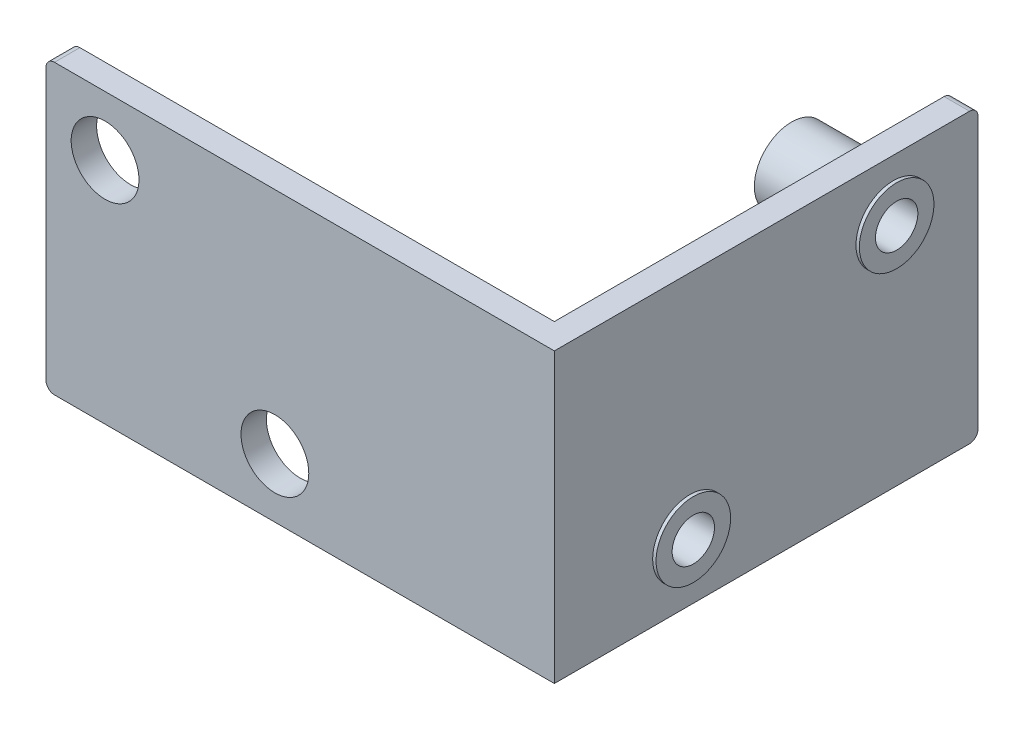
ISO-10303-21;
HEADER;
FILE_DESCRIPTION(('STEP AP214'),'2;1');
FILE_NAME('part.step','',(''),(''),'','','');
FILE_SCHEMA(('AUTOMOTIVE_DESIGN { 1 0 10303 214 1 1 1 1 }'));
ENDSEC;
DATA;
#1=APPLICATION_CONTEXT('core data for automotive mechanical design processes');
#2=APPLICATION_PROTOCOL_DEFINITION('international standard','automotive_design',2000,#1);
#3=PRODUCT_CONTEXT('',#1,'mechanical');
#4=PRODUCT('Part','Part','',(#3));
#5=PRODUCT_RELATED_PRODUCT_CATEGORY('part','',(#4));
#6=PRODUCT_DEFINITION_FORMATION('','',#4);
#7=PRODUCT_DEFINITION_CONTEXT('part definition',#1,'design');
#8=PRODUCT_DEFINITION('design','',#6,#7);
#9=PRODUCT_DEFINITION_SHAPE('','',#8);
#10=(LENGTH_UNIT() NAMED_UNIT(*) SI_UNIT(.MILLI.,.METRE.));
#11=(NAMED_UNIT(*) PLANE_ANGLE_UNIT() SI_UNIT($,.RADIAN.));
#12=(NAMED_UNIT(*) SI_UNIT($,.STERADIAN.) SOLID_ANGLE_UNIT());
#13=UNCERTAINTY_MEASURE_WITH_UNIT(LENGTH_MEASURE(1.E-05),#10,'distance_accuracy_value','');
#14=(GEOMETRIC_REPRESENTATION_CONTEXT(3) GLOBAL_UNCERTAINTY_ASSIGNED_CONTEXT((#13)) GLOBAL_UNIT_ASSIGNED_CONTEXT((#10,
#11,#12)) REPRESENTATION_CONTEXT('',''));
#15=CARTESIAN_POINT('',(0.,0.,0.));
#16=DIRECTION('',(0.,0.,1.));
#17=DIRECTION('',(1.,0.,0.));
#18=AXIS2_PLACEMENT_3D('',#15,#16,#17);
#19=CARTESIAN_POINT('',(21.0510654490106,-18.5667427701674,1.5));
#20=DIRECTION('',(-1.,0.,0.));
#21=DIRECTION('',(0.,0.,1.));
#22=AXIS2_PLACEMENT_3D('',#19,#20,#21);
#23=PLANE('',#22);
#24=CARTESIAN_POINT('',(21.0510654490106,-15.1074405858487,-6.5));
#25=DIRECTION('',(-1.,0.,0.));
#26=DIRECTION('',(0.,0.,1.));
#27=AXIS2_PLACEMENT_3D('',#24,#25,#26);
#28=CIRCLE('',#27,2.2);
#29=CARTESIAN_POINT('',(21.0510654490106,-15.1074405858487,-4.3));
#30=VERTEX_POINT('',#29);
#31=EDGE_CURVE('E169',#30,#30,#28,.F.);
#32=ORIENTED_EDGE('',*,*,#31,.F.);
#33=EDGE_LOOP('',(#32));
#34=FACE_BOUND('',#33,.T.);
#35=DIRECTION('',(0.,0.,-1.));
#36=VECTOR('',#35,1.);
#37=CARTESIAN_POINT('',(21.0510654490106,-18.5667427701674,1.5));
#38=LINE('',#37,#36);
#39=CARTESIAN_POINT('',(21.0510654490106,-18.5667427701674,1.5));
#40=VERTEX_POINT('',#39);
#41=CARTESIAN_POINT('',(21.0510654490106,-18.5667427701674,-23.));
#42=VERTEX_POINT('',#41);
#43=EDGE_CURVE('E221',#40,#42,#38,.T.);
#44=ORIENTED_EDGE('',*,*,#43,.T.);
#45=CARTESIAN_POINT('',(21.0510654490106,-18.0667427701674,-23.));
#46=DIRECTION('',(-1.,0.,0.));
#47=DIRECTION('',(0.,0.,1.));
#48=AXIS2_PLACEMENT_3D('',#45,#46,#47);
#49=CIRCLE('',#48,0.5);
#50=CARTESIAN_POINT('',(21.0510654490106,-18.0667427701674,-23.5));
#51=VERTEX_POINT('',#50);
#52=EDGE_CURVE('E198',#42,#51,#49,.F.);
#53=ORIENTED_EDGE('',*,*,#52,.T.);
#54=DIRECTION('',(0.,-1.,0.));
#55=VECTOR('',#54,1.);
#56=CARTESIAN_POINT('',(21.0510654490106,-1.56674277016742,-23.5));
#57=LINE('',#56,#55);
#58=CARTESIAN_POINT('',(21.0510654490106,-2.06674277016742,-23.5));
#59=VERTEX_POINT('',#58);
#60=EDGE_CURVE('E153',#59,#51,#57,.T.);
#61=ORIENTED_EDGE('',*,*,#60,.F.);
#62=CARTESIAN_POINT('',(21.0510654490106,-2.06674277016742,-23.));
#63=DIRECTION('',(-1.,0.,0.));
#64=DIRECTION('',(0.,0.,1.));
#65=AXIS2_PLACEMENT_3D('',#62,#63,#64);
#66=CIRCLE('',#65,0.5);
#67=CARTESIAN_POINT('',(21.0510654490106,-1.56674277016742,-23.));
#68=VERTEX_POINT('',#67);
#69=EDGE_CURVE('E196',#59,#68,#66,.F.);
#70=ORIENTED_EDGE('',*,*,#69,.T.);
#71=DIRECTION('',(0.,0.,-1.));
#72=VECTOR('',#71,1.);
#73=CARTESIAN_POINT('',(21.0510654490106,-1.56674277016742,1.5));
#74=LINE('',#73,#72);
#75=CARTESIAN_POINT('',(21.0510654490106,-1.56674277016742,1.5));
#76=VERTEX_POINT('',#75);
#77=EDGE_CURVE('E229',#76,#68,#74,.T.);
#78=ORIENTED_EDGE('',*,*,#77,.F.);
#79=DIRECTION('',(0.,1.,0.));
#80=VECTOR('',#79,1.);
#81=CARTESIAN_POINT('',(21.0510654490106,-18.5667427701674,1.5));
#82=LINE('',#81,#80);
#83=EDGE_CURVE('E223',#40,#76,#82,.T.);
#84=ORIENTED_EDGE('',*,*,#83,.F.);
#85=EDGE_LOOP('',(#44,#53,#61,#70,#78,#84));
#86=FACE_BOUND('',#85,.T.);
#87=CARTESIAN_POINT('',(21.0510654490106,-5.06674277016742,-18.5));
#88=DIRECTION('',(-1.,0.,0.));
#89=DIRECTION('',(0.,0.,1.));
#90=AXIS2_PLACEMENT_3D('',#87,#88,#89);
#91=CIRCLE('',#90,2.2);
#92=CARTESIAN_POINT('',(21.0510654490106,-5.06674277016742,-16.3));
#93=VERTEX_POINT('',#92);
#94=EDGE_CURVE('E479',#93,#93,#91,.F.);
#95=ORIENTED_EDGE('',*,*,#94,.F.);
#96=EDGE_LOOP('',(#95));
#97=FACE_BOUND('',#96,.T.);
#98=ADVANCED_FACE('F46',(#34,#86,#97),#23,.F.);
#99=CARTESIAN_POINT('',(19.5510654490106,-1.56674277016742,-23.5));
#100=DIRECTION('',(1.,0.,0.));
#101=DIRECTION('',(0.,1.,0.));
#102=AXIS2_PLACEMENT_3D('',#99,#100,#101);
#103=PLANE('',#102);
#104=CARTESIAN_POINT('',(19.5510654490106,-15.1074405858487,-6.5));
#105=DIRECTION('',(1.,0.,0.));
#106=DIRECTION('',(0.,1.,0.));
#107=AXIS2_PLACEMENT_3D('',#104,#105,#106);
#108=CIRCLE('',#107,2.2);
#109=CARTESIAN_POINT('',(19.5510654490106,-12.9074405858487,-6.5));
#110=VERTEX_POINT('',#109);
#111=EDGE_CURVE('E232',#110,#110,#108,.F.);
#112=ORIENTED_EDGE('',*,*,#111,.F.);
#113=EDGE_LOOP('',(#112));
#114=FACE_BOUND('',#113,.T.);
#115=DIRECTION('',(0.,1.,0.));
#116=VECTOR('',#115,1.);
#117=CARTESIAN_POINT('',(19.5510654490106,-1.56674277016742,-23.5));
#118=LINE('',#117,#116);
#119=CARTESIAN_POINT('',(19.5510654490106,-18.0667427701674,-23.5));
#120=VERTEX_POINT('',#119);
#121=CARTESIAN_POINT('',(19.5510654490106,-2.06674277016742,-23.5));
#122=VERTEX_POINT('',#121);
#123=EDGE_CURVE('E135',#120,#122,#118,.T.);
#124=ORIENTED_EDGE('',*,*,#123,.F.);
#125=CARTESIAN_POINT('',(19.5510654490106,-18.0667427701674,-23.));
#126=DIRECTION('',(1.,0.,0.));
#127=DIRECTION('',(0.,1.,0.));
#128=AXIS2_PLACEMENT_3D('',#125,#126,#127);
#129=CIRCLE('',#128,0.5);
#130=CARTESIAN_POINT('',(19.5510654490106,-18.5667427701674,-23.));
#131=VERTEX_POINT('',#130);
#132=EDGE_CURVE('E189',#120,#131,#129,.F.);
#133=ORIENTED_EDGE('',*,*,#132,.T.);
#134=DIRECTION('',(0.,0.,1.));
#135=VECTOR('',#134,1.);
#136=CARTESIAN_POINT('',(19.5510654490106,-18.5667427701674,-23.5));
#137=LINE('',#136,#135);
#138=CARTESIAN_POINT('',(19.5510654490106,-18.5667427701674,0.));
#139=VERTEX_POINT('',#138);
#140=EDGE_CURVE('E134',#131,#139,#137,.T.);
#141=ORIENTED_EDGE('',*,*,#140,.T.);
#142=DIRECTION('',(0.,1.,0.));
#143=VECTOR('',#142,1.);
#144=CARTESIAN_POINT('',(19.5510654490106,-1.56674277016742,0.));
#145=LINE('',#144,#143);
#146=CARTESIAN_POINT('',(19.5510654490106,-1.56674277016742,0.));
#147=VERTEX_POINT('',#146);
#148=EDGE_CURVE('E142',#139,#147,#145,.T.);
#149=ORIENTED_EDGE('',*,*,#148,.T.);
#150=DIRECTION('',(0.,0.,1.));
#151=VECTOR('',#150,1.);
#152=CARTESIAN_POINT('',(19.5510654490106,-1.56674277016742,-23.5));
#153=LINE('',#152,#151);
#154=CARTESIAN_POINT('',(19.5510654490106,-1.56674277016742,-23.));
#155=VERTEX_POINT('',#154);
#156=EDGE_CURVE('E123',#155,#147,#153,.T.);
#157=ORIENTED_EDGE('',*,*,#156,.F.);
#158=CARTESIAN_POINT('',(19.5510654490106,-2.06674277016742,-23.));
#159=DIRECTION('',(1.,0.,0.));
#160=DIRECTION('',(0.,1.,0.));
#161=AXIS2_PLACEMENT_3D('',#158,#159,#160);
#162=CIRCLE('',#161,0.5);
#163=EDGE_CURVE('E466',#155,#122,#162,.F.);
#164=ORIENTED_EDGE('',*,*,#163,.T.);
#165=EDGE_LOOP('',(#124,#133,#141,#149,#157,#164));
#166=FACE_BOUND('',#165,.T.);
#167=CARTESIAN_POINT('',(19.5510654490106,-5.06674277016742,-18.5));
#168=DIRECTION('',(1.,0.,0.));
#169=DIRECTION('',(0.,1.,0.));
#170=AXIS2_PLACEMENT_3D('',#167,#168,#169);
#171=CIRCLE('',#170,2.2);
#172=CARTESIAN_POINT('',(19.5510654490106,-2.86674277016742,-18.5));
#173=VERTEX_POINT('',#172);
#174=EDGE_CURVE('E476',#173,#173,#171,.F.);
#175=ORIENTED_EDGE('',*,*,#174,.F.);
#176=EDGE_LOOP('',(#175));
#177=FACE_BOUND('',#176,.T.);
#178=ADVANCED_FACE('F150',(#114,#166,#177),#103,.F.);
#179=CARTESIAN_POINT('',(-8.94893455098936,-18.5667427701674,1.5));
#180=DIRECTION('',(1.,0.,0.));
#181=DIRECTION('',(0.,0.,-1.));
#182=AXIS2_PLACEMENT_3D('',#179,#180,#181);
#183=PLANE('',#182);
#184=DIRECTION('',(0.,-1.,0.));
#185=VECTOR('',#184,1.);
#186=CARTESIAN_POINT('',(-8.94893455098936,-18.5667427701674,0.));
#187=LINE('',#186,#185);
#188=CARTESIAN_POINT('',(-8.94893455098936,-2.06674277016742,0.));
#189=VERTEX_POINT('',#188);
#190=CARTESIAN_POINT('',(-8.94893455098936,-18.0667427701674,0.));
#191=VERTEX_POINT('',#190);
#192=EDGE_CURVE('E181',#189,#191,#187,.T.);
#193=ORIENTED_EDGE('',*,*,#192,.T.);
#194=DIRECTION('',(0.,0.,-1.));
#195=VECTOR('',#194,1.);
#196=CARTESIAN_POINT('',(-8.94893455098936,-18.0667427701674,1.5));
#197=LINE('',#196,#195);
#198=CARTESIAN_POINT('',(-8.94893455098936,-18.0667427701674,1.5));
#199=VERTEX_POINT('',#198);
#200=EDGE_CURVE('E61',#191,#199,#197,.F.);
#201=ORIENTED_EDGE('',*,*,#200,.T.);
#202=DIRECTION('',(0.,-1.,0.));
#203=VECTOR('',#202,1.);
#204=CARTESIAN_POINT('',(-8.94893455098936,-18.5667427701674,1.5));
#205=LINE('',#204,#203);
#206=CARTESIAN_POINT('',(-8.94893455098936,-2.06674277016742,1.5));
#207=VERTEX_POINT('',#206);
#208=EDGE_CURVE('E145',#207,#199,#205,.T.);
#209=ORIENTED_EDGE('',*,*,#208,.F.);
#210=DIRECTION('',(0.,0.,-1.));
#211=VECTOR('',#210,1.);
#212=CARTESIAN_POINT('',(-8.94893455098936,-2.06674277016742,1.5));
#213=LINE('',#212,#211);
#214=EDGE_CURVE('E206',#207,#189,#213,.T.);
#215=ORIENTED_EDGE('',*,*,#214,.T.);
#216=EDGE_LOOP('',(#193,#201,#209,#215));
#217=FACE_BOUND('',#216,.T.);
#218=ADVANCED_FACE('F48',(#217),#183,.F.);
#219=CARTESIAN_POINT('',(-8.94893455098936,-18.5667427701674,1.5));
#220=DIRECTION('',(0.,1.,0.));
#221=DIRECTION('',(0.,0.,1.));
#222=AXIS2_PLACEMENT_3D('',#219,#220,#221);
#223=PLANE('',#222);
#224=ORIENTED_EDGE('',*,*,#140,.F.);
#225=DIRECTION('',(-1.,0.,0.));
#226=VECTOR('',#225,1.);
#227=CARTESIAN_POINT('',(21.0510654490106,-18.5667427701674,-23.));
#228=LINE('',#227,#226);
#229=EDGE_CURVE('E194',#131,#42,#228,.F.);
#230=ORIENTED_EDGE('',*,*,#229,.T.);
#231=ORIENTED_EDGE('',*,*,#43,.F.);
#232=DIRECTION('',(1.,0.,0.));
#233=VECTOR('',#232,1.);
#234=CARTESIAN_POINT('',(-8.94893455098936,-18.5667427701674,1.5));
#235=LINE('',#234,#233);
#236=CARTESIAN_POINT('',(-8.44893455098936,-18.5667427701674,1.5));
#237=VERTEX_POINT('',#236);
#238=EDGE_CURVE('E219',#237,#40,#235,.T.);
#239=ORIENTED_EDGE('',*,*,#238,.F.);
#240=DIRECTION('',(0.,0.,-1.));
#241=VECTOR('',#240,1.);
#242=CARTESIAN_POINT('',(-8.44893455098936,-18.5667427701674,1.5));
#243=LINE('',#242,#241);
#244=CARTESIAN_POINT('',(-8.44893455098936,-18.5667427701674,0.));
#245=VERTEX_POINT('',#244);
#246=EDGE_CURVE('E191',#237,#245,#243,.T.);
#247=ORIENTED_EDGE('',*,*,#246,.T.);
#248=DIRECTION('',(1.,0.,0.));
#249=VECTOR('',#248,1.);
#250=CARTESIAN_POINT('',(-8.94893455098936,-18.5667427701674,0.));
#251=LINE('',#250,#249);
#252=EDGE_CURVE('E146',#245,#139,#251,.T.);
#253=ORIENTED_EDGE('',*,*,#252,.T.);
#254=EDGE_LOOP('',(#224,#230,#231,#239,#247,#253));
#255=FACE_BOUND('',#254,.T.);
#256=ADVANCED_FACE('F217',(#255),#223,.F.);
#257=CARTESIAN_POINT('',(-8.94893455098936,-1.56674277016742,1.5));
#258=DIRECTION('',(0.,-1.,0.));
#259=DIRECTION('',(0.,0.,-1.));
#260=AXIS2_PLACEMENT_3D('',#257,#258,#259);
#261=PLANE('',#260);
#262=ORIENTED_EDGE('',*,*,#77,.T.);
#263=DIRECTION('',(1.,0.,0.));
#264=VECTOR('',#263,1.);
#265=CARTESIAN_POINT('',(19.5510654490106,-1.56674277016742,-23.));
#266=LINE('',#265,#264);
#267=EDGE_CURVE('E130',#68,#155,#266,.F.);
#268=ORIENTED_EDGE('',*,*,#267,.T.);
#269=ORIENTED_EDGE('',*,*,#156,.T.);
#270=DIRECTION('',(-1.,0.,0.));
#271=VECTOR('',#270,1.);
#272=CARTESIAN_POINT('',(-8.94893455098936,-1.56674277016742,0.));
#273=LINE('',#272,#271);
#274=CARTESIAN_POINT('',(-8.44893455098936,-1.56674277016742,0.));
#275=VERTEX_POINT('',#274);
#276=EDGE_CURVE('E127',#147,#275,#273,.T.);
#277=ORIENTED_EDGE('',*,*,#276,.T.);
#278=DIRECTION('',(0.,0.,-1.));
#279=VECTOR('',#278,1.);
#280=CARTESIAN_POINT('',(-8.44893455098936,-1.56674277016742,1.5));
#281=LINE('',#280,#279);
#282=CARTESIAN_POINT('',(-8.44893455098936,-1.56674277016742,1.5));
#283=VERTEX_POINT('',#282);
#284=EDGE_CURVE('E200',#275,#283,#281,.F.);
#285=ORIENTED_EDGE('',*,*,#284,.T.);
#286=DIRECTION('',(-1.,0.,0.));
#287=VECTOR('',#286,1.);
#288=CARTESIAN_POINT('',(-8.94893455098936,-1.56674277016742,1.5));
#289=LINE('',#288,#287);
#290=EDGE_CURVE('E225',#76,#283,#289,.T.);
#291=ORIENTED_EDGE('',*,*,#290,.F.);
#292=EDGE_LOOP('',(#262,#268,#269,#277,#285,#291));
#293=FACE_BOUND('',#292,.T.);
#294=ADVANCED_FACE('F126',(#293),#261,.F.);
#295=CARTESIAN_POINT('',(-8.94893455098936,-1.56674277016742,1.5));
#296=DIRECTION('',(0.,0.,-1.));
#297=DIRECTION('',(-1.,0.,0.));
#298=AXIS2_PLACEMENT_3D('',#295,#296,#297);
#299=PLANE('',#298);
#300=CARTESIAN_POINT('',(4.55843129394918,-15.0700643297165,1.5));
#301=DIRECTION('',(0.,0.,1.));
#302=DIRECTION('',(1.,0.,0.));
#303=AXIS2_PLACEMENT_3D('',#300,#301,#302);
#304=CIRCLE('',#303,2.);
#305=CARTESIAN_POINT('',(6.55843129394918,-15.0700643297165,1.5));
#306=VERTEX_POINT('',#305);
#307=EDGE_CURVE('E173',#306,#306,#304,.T.);
#308=ORIENTED_EDGE('',*,*,#307,.F.);
#309=EDGE_LOOP('',(#308));
#310=FACE_BOUND('',#309,.T.);
#311=CARTESIAN_POINT('',(-5.46307738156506,-5.07616311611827,1.5));
#312=DIRECTION('',(0.,0.,1.));
#313=DIRECTION('',(1.,0.,0.));
#314=AXIS2_PLACEMENT_3D('',#311,#312,#313);
#315=CIRCLE('',#314,2.);
#316=CARTESIAN_POINT('',(-3.46307738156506,-5.07616311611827,1.5));
#317=VERTEX_POINT('',#316);
#318=EDGE_CURVE('E177',#317,#317,#315,.T.);
#319=ORIENTED_EDGE('',*,*,#318,.F.);
#320=EDGE_LOOP('',(#319));
#321=FACE_BOUND('',#320,.T.);
#322=ORIENTED_EDGE('',*,*,#208,.T.);
#323=CARTESIAN_POINT('',(-8.44893455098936,-18.0667427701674,1.5));
#324=DIRECTION('',(0.,0.,-1.));
#325=DIRECTION('',(-1.,0.,0.));
#326=AXIS2_PLACEMENT_3D('',#323,#324,#325);
#327=CIRCLE('',#326,0.5);
#328=EDGE_CURVE('E13',#199,#237,#327,.F.);
#329=ORIENTED_EDGE('',*,*,#328,.T.);
#330=ORIENTED_EDGE('',*,*,#238,.T.);
#331=ORIENTED_EDGE('',*,*,#83,.T.);
#332=ORIENTED_EDGE('',*,*,#290,.T.);
#333=CARTESIAN_POINT('',(-8.44893455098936,-2.06674277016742,1.5));
#334=DIRECTION('',(0.,0.,-1.));
#335=DIRECTION('',(-1.,0.,0.));
#336=AXIS2_PLACEMENT_3D('',#333,#334,#335);
#337=CIRCLE('',#336,0.5);
#338=EDGE_CURVE('E54',#283,#207,#337,.F.);
#339=ORIENTED_EDGE('',*,*,#338,.T.);
#340=EDGE_LOOP('',(#322,#329,#330,#331,#332,#339));
#341=FACE_BOUND('',#340,.T.);
#342=ADVANCED_FACE('F242',(#310,#321,#341),#299,.F.);
#343=CARTESIAN_POINT('',(-8.94893455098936,-1.56674277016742,0.));
#344=DIRECTION('',(0.,0.,-1.));
#345=DIRECTION('',(-1.,0.,0.));
#346=AXIS2_PLACEMENT_3D('',#343,#344,#345);
#347=PLANE('',#346);
#348=ORIENTED_EDGE('',*,*,#252,.F.);
#349=CARTESIAN_POINT('',(-8.44893455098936,-18.0667427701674,0.));
#350=DIRECTION('',(0.,0.,-1.));
#351=DIRECTION('',(-1.,0.,0.));
#352=AXIS2_PLACEMENT_3D('',#349,#350,#351);
#353=CIRCLE('',#352,0.5);
#354=EDGE_CURVE('E204',#245,#191,#353,.T.);
#355=ORIENTED_EDGE('',*,*,#354,.T.);
#356=ORIENTED_EDGE('',*,*,#192,.F.);
#357=CARTESIAN_POINT('',(-8.44893455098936,-2.06674277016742,0.));
#358=DIRECTION('',(0.,0.,-1.));
#359=DIRECTION('',(-1.,0.,0.));
#360=AXIS2_PLACEMENT_3D('',#357,#358,#359);
#361=CIRCLE('',#360,0.5);
#362=EDGE_CURVE('E144',#189,#275,#361,.T.);
#363=ORIENTED_EDGE('',*,*,#362,.T.);
#364=ORIENTED_EDGE('',*,*,#276,.F.);
#365=ORIENTED_EDGE('',*,*,#148,.F.);
#366=EDGE_LOOP('',(#348,#355,#356,#363,#364,#365));
#367=FACE_BOUND('',#366,.T.);
#368=CARTESIAN_POINT('',(4.55843129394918,-15.0700643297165,0.));
#369=DIRECTION('',(0.,0.,-1.));
#370=DIRECTION('',(-1.,0.,0.));
#371=AXIS2_PLACEMENT_3D('',#368,#369,#370);
#372=CIRCLE('',#371,2.);
#373=CARTESIAN_POINT('',(2.55843129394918,-15.0700643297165,0.));
#374=VERTEX_POINT('',#373);
#375=EDGE_CURVE('E176',#374,#374,#372,.T.);
#376=ORIENTED_EDGE('',*,*,#375,.F.);
#377=EDGE_LOOP('',(#376));
#378=FACE_BOUND('',#377,.T.);
#379=CARTESIAN_POINT('',(-5.46307738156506,-5.07616311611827,0.));
#380=DIRECTION('',(0.,0.,-1.));
#381=DIRECTION('',(-1.,0.,0.));
#382=AXIS2_PLACEMENT_3D('',#379,#380,#381);
#383=CIRCLE('',#382,2.);
#384=CARTESIAN_POINT('',(-7.46307738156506,-5.07616311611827,0.));
#385=VERTEX_POINT('',#384);
#386=EDGE_CURVE('E180',#385,#385,#383,.T.);
#387=ORIENTED_EDGE('',*,*,#386,.F.);
#388=EDGE_LOOP('',(#387));
#389=FACE_BOUND('',#388,.T.);
#390=ADVANCED_FACE('F140',(#367,#378,#389),#347,.T.);
#391=CARTESIAN_POINT('',(-5.46307738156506,-5.07616311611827,-0.5));
#392=DIRECTION('',(0.,0.,1.));
#393=DIRECTION('',(1.,0.,0.));
#394=AXIS2_PLACEMENT_3D('',#391,#392,#393);
#395=CYLINDRICAL_SURFACE('',#394,2.);
#396=ORIENTED_EDGE('',*,*,#386,.T.);
#397=EDGE_LOOP('',(#396));
#398=FACE_BOUND('',#397,.T.);
#399=ORIENTED_EDGE('',*,*,#318,.T.);
#400=EDGE_LOOP('',(#399));
#401=FACE_BOUND('',#400,.T.);
#402=ADVANCED_FACE('F241',(#398,#401),#395,.F.);
#403=CARTESIAN_POINT('',(4.55843129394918,-15.0700643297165,-0.5));
#404=DIRECTION('',(0.,0.,1.));
#405=DIRECTION('',(1.,0.,0.));
#406=AXIS2_PLACEMENT_3D('',#403,#404,#405);
#407=CYLINDRICAL_SURFACE('',#406,2.);
#408=ORIENTED_EDGE('',*,*,#375,.T.);
#409=EDGE_LOOP('',(#408));
#410=FACE_BOUND('',#409,.T.);
#411=ORIENTED_EDGE('',*,*,#307,.T.);
#412=EDGE_LOOP('',(#411));
#413=FACE_BOUND('',#412,.T.);
#414=ADVANCED_FACE('F237',(#410,#413),#407,.F.);
#415=CARTESIAN_POINT('',(21.0510654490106,-18.5667427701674,-23.5));
#416=DIRECTION('',(0.,0.,-1.));
#417=DIRECTION('',(-1.,0.,0.));
#418=AXIS2_PLACEMENT_3D('',#415,#416,#417);
#419=PLANE('',#418);
#420=ORIENTED_EDGE('',*,*,#60,.T.);
#421=DIRECTION('',(-1.,0.,0.));
#422=VECTOR('',#421,1.);
#423=CARTESIAN_POINT('',(19.5510654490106,-18.0667427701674,-23.5));
#424=LINE('',#423,#422);
#425=EDGE_CURVE('E468',#51,#120,#424,.T.);
#426=ORIENTED_EDGE('',*,*,#425,.T.);
#427=ORIENTED_EDGE('',*,*,#123,.T.);
#428=DIRECTION('',(1.,0.,0.));
#429=VECTOR('',#428,1.);
#430=CARTESIAN_POINT('',(21.0510654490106,-2.06674277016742,-23.5));
#431=LINE('',#430,#429);
#432=EDGE_CURVE('E467',#122,#59,#431,.T.);
#433=ORIENTED_EDGE('',*,*,#432,.T.);
#434=EDGE_LOOP('',(#420,#426,#427,#433));
#435=FACE_BOUND('',#434,.T.);
#436=ADVANCED_FACE('F388',(#435),#419,.T.);
#437=CARTESIAN_POINT('',(21.2510654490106,-15.1074405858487,-6.5));
#438=DIRECTION('',(-1.,0.,0.));
#439=DIRECTION('',(0.,0.,1.));
#440=AXIS2_PLACEMENT_3D('',#437,#438,#439);
#441=CYLINDRICAL_SURFACE('',#440,2.2);
#442=CARTESIAN_POINT('',(15.0510654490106,-15.1074405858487,-6.5));
#443=DIRECTION('',(1.,0.,0.));
#444=DIRECTION('',(0.,0.,-1.));
#445=AXIS2_PLACEMENT_3D('',#442,#443,#444);
#446=CIRCLE('',#445,2.2);
#447=CARTESIAN_POINT('',(15.0510654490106,-15.1074405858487,-8.7));
#448=VERTEX_POINT('',#447);
#449=EDGE_CURVE('E491',#448,#448,#446,.T.);
#450=ORIENTED_EDGE('',*,*,#449,.T.);
#451=EDGE_LOOP('',(#450));
#452=FACE_BOUND('',#451,.T.);
#453=ORIENTED_EDGE('',*,*,#111,.T.);
#454=EDGE_LOOP('',(#453));
#455=FACE_BOUND('',#454,.T.);
#456=ADVANCED_FACE('F361',(#452,#455),#441,.T.);
#457=CARTESIAN_POINT('',(15.0510654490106,-15.1074405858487,-6.5));
#458=DIRECTION('',(1.,0.,0.));
#459=DIRECTION('',(0.,0.,-1.));
#460=AXIS2_PLACEMENT_3D('',#457,#458,#459);
#461=PLANE('',#460);
#462=CARTESIAN_POINT('',(15.0510654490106,-15.1074405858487,-6.5));
#463=DIRECTION('',(1.,0.,0.));
#464=DIRECTION('',(0.,0.,-1.));
#465=AXIS2_PLACEMENT_3D('',#462,#463,#464);
#466=CIRCLE('',#465,1.25);
#467=CARTESIAN_POINT('',(15.0510654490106,-15.1074405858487,-7.75));
#468=VERTEX_POINT('',#467);
#469=EDGE_CURVE('E488',#468,#468,#466,.T.);
#470=ORIENTED_EDGE('',*,*,#469,.T.);
#471=EDGE_LOOP('',(#470));
#472=FACE_BOUND('',#471,.T.);
#473=ORIENTED_EDGE('',*,*,#449,.F.);
#474=EDGE_LOOP('',(#473));
#475=FACE_BOUND('',#474,.T.);
#476=ADVANCED_FACE('F369',(#472,#475),#461,.F.);
#477=CARTESIAN_POINT('',(19.0510654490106,-15.1074405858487,-6.5));
#478=DIRECTION('',(1.,0.,0.));
#479=DIRECTION('',(0.,0.,-1.));
#480=AXIS2_PLACEMENT_3D('',#477,#478,#479);
#481=CYLINDRICAL_SURFACE('',#480,1.25);
#482=ORIENTED_EDGE('',*,*,#469,.F.);
#483=EDGE_LOOP('',(#482));
#484=FACE_BOUND('',#483,.T.);
#485=CARTESIAN_POINT('',(21.2510654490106,-15.1074405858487,-6.5));
#486=DIRECTION('',(1.,0.,0.));
#487=DIRECTION('',(0.,0.,-1.));
#488=AXIS2_PLACEMENT_3D('',#485,#486,#487);
#489=CIRCLE('',#488,1.25);
#490=CARTESIAN_POINT('',(21.2510654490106,-15.1074405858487,-7.75));
#491=VERTEX_POINT('',#490);
#492=EDGE_CURVE('E159',#491,#491,#489,.T.);
#493=ORIENTED_EDGE('',*,*,#492,.T.);
#494=EDGE_LOOP('',(#493));
#495=FACE_BOUND('',#494,.T.);
#496=ADVANCED_FACE('F358',(#484,#495),#481,.F.);
#497=CARTESIAN_POINT('',(21.2510654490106,-15.1074405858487,-6.5));
#498=DIRECTION('',(1.,0.,0.));
#499=DIRECTION('',(0.,0.,-1.));
#500=AXIS2_PLACEMENT_3D('',#497,#498,#499);
#501=CIRCLE('',#500,2.2);
#502=CARTESIAN_POINT('',(21.2510654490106,-15.1074405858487,-8.7));
#503=VERTEX_POINT('',#502);
#504=EDGE_CURVE('E154',#503,#503,#501,.T.);
#505=ORIENTED_EDGE('',*,*,#504,.F.);
#506=EDGE_LOOP('',(#505));
#507=FACE_BOUND('',#506,.T.);
#508=ORIENTED_EDGE('',*,*,#31,.T.);
#509=EDGE_LOOP('',(#508));
#510=FACE_BOUND('',#509,.T.);
#511=ADVANCED_FACE('F348',(#507,#510),#441,.T.);
#512=CARTESIAN_POINT('',(21.2510654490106,-15.1074405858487,-6.5));
#513=DIRECTION('',(1.,0.,0.));
#514=DIRECTION('',(0.,0.,-1.));
#515=AXIS2_PLACEMENT_3D('',#512,#513,#514);
#516=PLANE('',#515);
#517=ORIENTED_EDGE('',*,*,#504,.T.);
#518=EDGE_LOOP('',(#517));
#519=FACE_BOUND('',#518,.T.);
#520=ORIENTED_EDGE('',*,*,#492,.F.);
#521=EDGE_LOOP('',(#520));
#522=FACE_BOUND('',#521,.T.);
#523=ADVANCED_FACE('F339',(#519,#522),#516,.T.);
#524=CARTESIAN_POINT('',(21.2510654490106,-5.06674277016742,-18.5));
#525=DIRECTION('',(-1.,0.,0.));
#526=DIRECTION('',(0.,0.,1.));
#527=AXIS2_PLACEMENT_3D('',#524,#525,#526);
#528=CYLINDRICAL_SURFACE('',#527,2.2);
#529=CARTESIAN_POINT('',(15.0510654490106,-5.06674277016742,-18.5));
#530=DIRECTION('',(1.,0.,0.));
#531=DIRECTION('',(0.,0.,-1.));
#532=AXIS2_PLACEMENT_3D('',#529,#530,#531);
#533=CIRCLE('',#532,2.2);
#534=CARTESIAN_POINT('',(15.0510654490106,-5.06674277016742,-20.7));
#535=VERTEX_POINT('',#534);
#536=EDGE_CURVE('E507',#535,#535,#533,.T.);
#537=ORIENTED_EDGE('',*,*,#536,.T.);
#538=EDGE_LOOP('',(#537));
#539=FACE_BOUND('',#538,.T.);
#540=ORIENTED_EDGE('',*,*,#174,.T.);
#541=EDGE_LOOP('',(#540));
#542=FACE_BOUND('',#541,.T.);
#543=ADVANCED_FACE('F312',(#539,#542),#528,.T.);
#544=CARTESIAN_POINT('',(15.0510654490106,-5.06674277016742,-18.5));
#545=DIRECTION('',(1.,0.,0.));
#546=DIRECTION('',(0.,0.,-1.));
#547=AXIS2_PLACEMENT_3D('',#544,#545,#546);
#548=PLANE('',#547);
#549=CARTESIAN_POINT('',(15.0510654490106,-5.06674277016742,-18.5));
#550=DIRECTION('',(1.,0.,0.));
#551=DIRECTION('',(0.,0.,-1.));
#552=AXIS2_PLACEMENT_3D('',#549,#550,#551);
#553=CIRCLE('',#552,1.25);
#554=CARTESIAN_POINT('',(15.0510654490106,-5.06674277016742,-19.75));
#555=VERTEX_POINT('',#554);
#556=EDGE_CURVE('E511',#555,#555,#553,.T.);
#557=ORIENTED_EDGE('',*,*,#556,.T.);
#558=EDGE_LOOP('',(#557));
#559=FACE_BOUND('',#558,.T.);
#560=ORIENTED_EDGE('',*,*,#536,.F.);
#561=EDGE_LOOP('',(#560));
#562=FACE_BOUND('',#561,.T.);
#563=ADVANCED_FACE('F320',(#559,#562),#548,.F.);
#564=CARTESIAN_POINT('',(19.0510654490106,-5.06674277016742,-18.5));
#565=DIRECTION('',(1.,0.,0.));
#566=DIRECTION('',(0.,0.,-1.));
#567=AXIS2_PLACEMENT_3D('',#564,#565,#566);
#568=CYLINDRICAL_SURFACE('',#567,1.25);
#569=ORIENTED_EDGE('',*,*,#556,.F.);
#570=EDGE_LOOP('',(#569));
#571=FACE_BOUND('',#570,.T.);
#572=CARTESIAN_POINT('',(21.2510654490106,-5.06674277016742,-18.5));
#573=DIRECTION('',(1.,0.,0.));
#574=DIRECTION('',(0.,0.,-1.));
#575=AXIS2_PLACEMENT_3D('',#572,#573,#574);
#576=CIRCLE('',#575,1.25);
#577=CARTESIAN_POINT('',(21.2510654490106,-5.06674277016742,-19.75));
#578=VERTEX_POINT('',#577);
#579=EDGE_CURVE('E504',#578,#578,#576,.T.);
#580=ORIENTED_EDGE('',*,*,#579,.T.);
#581=EDGE_LOOP('',(#580));
#582=FACE_BOUND('',#581,.T.);
#583=ADVANCED_FACE('F309',(#571,#582),#568,.F.);
#584=CARTESIAN_POINT('',(21.2510654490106,-5.06674277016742,-18.5));
#585=DIRECTION('',(1.,0.,0.));
#586=DIRECTION('',(0.,0.,-1.));
#587=AXIS2_PLACEMENT_3D('',#584,#585,#586);
#588=CIRCLE('',#587,2.2);
#589=CARTESIAN_POINT('',(21.2510654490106,-5.06674277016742,-20.7));
#590=VERTEX_POINT('',#589);
#591=EDGE_CURVE('E486',#590,#590,#588,.T.);
#592=ORIENTED_EDGE('',*,*,#591,.F.);
#593=EDGE_LOOP('',(#592));
#594=FACE_BOUND('',#593,.T.);
#595=ORIENTED_EDGE('',*,*,#94,.T.);
#596=EDGE_LOOP('',(#595));
#597=FACE_BOUND('',#596,.T.);
#598=ADVANCED_FACE('F297',(#594,#597),#528,.T.);
#599=CARTESIAN_POINT('',(21.2510654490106,-5.06674277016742,-18.5));
#600=DIRECTION('',(1.,0.,0.));
#601=DIRECTION('',(0.,0.,-1.));
#602=AXIS2_PLACEMENT_3D('',#599,#600,#601);
#603=PLANE('',#602);
#604=ORIENTED_EDGE('',*,*,#591,.T.);
#605=EDGE_LOOP('',(#604));
#606=FACE_BOUND('',#605,.T.);
#607=ORIENTED_EDGE('',*,*,#579,.F.);
#608=EDGE_LOOP('',(#607));
#609=FACE_BOUND('',#608,.T.);
#610=ADVANCED_FACE('F291',(#606,#609),#603,.T.);
#611=CARTESIAN_POINT('',(21.0510654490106,-18.0667427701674,-23.));
#612=DIRECTION('',(1.,0.,0.));
#613=DIRECTION('',(0.,0.,-1.));
#614=AXIS2_PLACEMENT_3D('',#611,#612,#613);
#615=CYLINDRICAL_SURFACE('',#614,0.5);
#616=ORIENTED_EDGE('',*,*,#52,.F.);
#617=ORIENTED_EDGE('',*,*,#229,.F.);
#618=ORIENTED_EDGE('',*,*,#132,.F.);
#619=ORIENTED_EDGE('',*,*,#425,.F.);
#620=EDGE_LOOP('',(#616,#617,#618,#619));
#621=FACE_BOUND('',#620,.T.);
#622=ADVANCED_FACE('F296',(#621),#615,.T.);
#623=CARTESIAN_POINT('',(21.0510654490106,-2.06674277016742,-23.));
#624=DIRECTION('',(-1.,0.,0.));
#625=DIRECTION('',(0.,0.,1.));
#626=AXIS2_PLACEMENT_3D('',#623,#624,#625);
#627=CYLINDRICAL_SURFACE('',#626,0.5);
#628=ORIENTED_EDGE('',*,*,#163,.F.);
#629=ORIENTED_EDGE('',*,*,#267,.F.);
#630=ORIENTED_EDGE('',*,*,#69,.F.);
#631=ORIENTED_EDGE('',*,*,#432,.F.);
#632=EDGE_LOOP('',(#628,#629,#630,#631));
#633=FACE_BOUND('',#632,.T.);
#634=ADVANCED_FACE('F429',(#633),#627,.T.);
#635=CARTESIAN_POINT('',(-8.44893455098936,-18.0667427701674,1.5));
#636=DIRECTION('',(0.,0.,-1.));
#637=DIRECTION('',(-1.,0.,0.));
#638=AXIS2_PLACEMENT_3D('',#635,#636,#637);
#639=CYLINDRICAL_SURFACE('',#638,0.5);
#640=ORIENTED_EDGE('',*,*,#328,.F.);
#641=ORIENTED_EDGE('',*,*,#200,.F.);
#642=ORIENTED_EDGE('',*,*,#354,.F.);
#643=ORIENTED_EDGE('',*,*,#246,.F.);
#644=EDGE_LOOP('',(#640,#641,#642,#643));
#645=FACE_BOUND('',#644,.T.);
#646=ADVANCED_FACE('F214',(#645),#639,.T.);
#647=CARTESIAN_POINT('',(-8.44893455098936,-2.06674277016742,1.5));
#648=DIRECTION('',(0.,0.,-1.));
#649=DIRECTION('',(-1.,0.,0.));
#650=AXIS2_PLACEMENT_3D('',#647,#648,#649);
#651=CYLINDRICAL_SURFACE('',#650,0.5);
#652=ORIENTED_EDGE('',*,*,#338,.F.);
#653=ORIENTED_EDGE('',*,*,#284,.F.);
#654=ORIENTED_EDGE('',*,*,#362,.F.);
#655=ORIENTED_EDGE('',*,*,#214,.F.);
#656=EDGE_LOOP('',(#652,#653,#654,#655));
#657=FACE_BOUND('',#656,.T.);
#658=ADVANCED_FACE('F448',(#657),#651,.T.);
#659=CLOSED_SHELL('',(#98,#178,#218,#256,#294,#342,#390,#402,#414,#436,#456,#476,#496,#511,#523,
#543,#563,#583,#598,#610,#622,#634,#646,#658));
#660=MANIFOLD_SOLID_BREP('B2',#659);
#661=ADVANCED_BREP_SHAPE_REPRESENTATION('',(#18,#660),#14);
#662=SHAPE_DEFINITION_REPRESENTATION(#9,#661);
ENDSEC;
END-ISO-10303-21;
